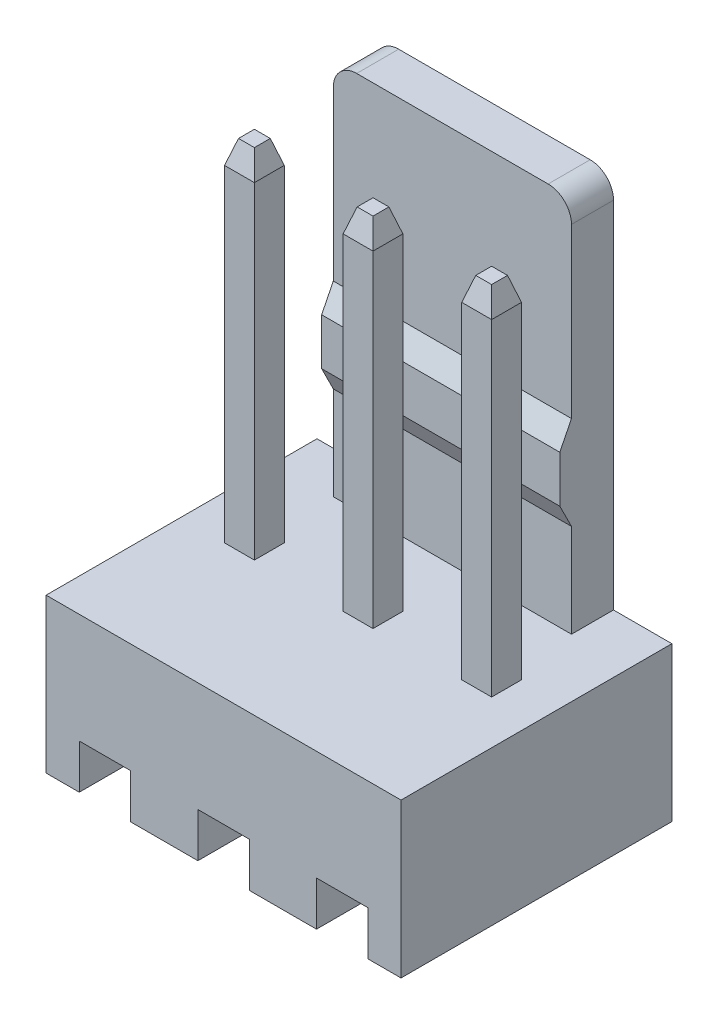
from build123d import *
from OCP.BRepFilletAPI import BRepFilletAPI_MakeChamfer

# Parameters (mm, degrees)
BASE_EXTRUDE_DEPTH  = 3.8
SKETCH2_W           = 2.25
SKETCH2_H           = 9.1
SKETCH2_W_2         = 1.1
SKETCH2_H_2         = 0.95
CUT_EXTRUDE1_DEPTH  = 14.343163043
FILLET1_R           = 0.5
SKETCH3_W           = 0.64
SKETCH3_H           = 0.64
BOSS_EXTRUDE1_DEPTH = 7.5
CHAMFER1_SIZE       = 0.5
CHAMFER1_SIZE2      = 0.15


with BuildPart() as part:
    # Sketch1 → Base-Extrude (new, symmetric)
    with BuildSketch(Plane(origin=(0, 0, 0), x_dir=(0, 0, -1), z_dir=(1, 0, 0))):
        Polygon((2.6, 0), (2.6, 11.4), (1.7, 11.4), (1.7, 7.3), (1.45, 6.8), (1.45, 5.8), (1.7, 5.3), (1.7, 3.3), (-3.2, 3.3), (-3.2, 0), align=None)
    extrude(amount=BASE_EXTRUDE_DEPTH, both=True)

    # Sketch2 → Cut-Extrude1 (cut, through all)
    with BuildSketch(Plane(origin=(0, 0, -2.6), x_dir=(-1, 0, 0), z_dir=(0, 0, -1))):
        with Locations((3.675, 7.85)):
            Rectangle(SKETCH2_W, SKETCH2_H)
        with Locations((-3.675, 7.85)):
            Rectangle(SKETCH2_W, SKETCH2_H)
        with Locations((0, 0.475)):
            Rectangle(SKETCH2_W_2, SKETCH2_H_2)
        with Locations((2.54, 0.475)):
            Rectangle(SKETCH2_W_2, SKETCH2_H_2)
        with Locations((-2.54, 0.475)):
            Rectangle(SKETCH2_W_2, SKETCH2_H_2)
    extrude(amount=-CUT_EXTRUDE1_DEPTH, mode=Mode.SUBTRACT)

    # Fillet1
    fillet1_edges = [part.edges().sort_by_distance(p)[0] for p in [
        (-2.55, 11.4, -2.15),
        (2.55, 11.4, -2.15),
    ]]
    fillet(fillet1_edges, radius=FILLET1_R)

    # Sketch3 → Boss-Extrude1 (add)
    with BuildSketch(Plane(origin=(0, 3.3, 0), x_dir=(-1, 0, 0), z_dir=(0, 1, 0))):
        with Locations((2.54, 0)):
            Rectangle(SKETCH3_W, SKETCH3_H)
        Rectangle(SKETCH3_W, SKETCH3_H)
        with Locations((-2.54, 0)):
            Rectangle(SKETCH3_W, SKETCH3_H)
    extrude(amount=BOSS_EXTRUDE1_DEPTH)

    # Chamfer1: one chamfer whose edges measure the first distance from different faces: ONE call of the kernel's chamfer builder (chamfer() names one face for all edges)
    chamfer1_edges_1 = [part.edges().sort_by_distance(p)[0] for p in [
        (0, 10.8, 0.32),
    ]]
    chamfer1_side_1 = [part.faces().sort_by_distance(p)[0] for p in [
        (0, 7.05, 0.32),
    ]]
    chamfer1_edges_2 = [part.edges().sort_by_distance(p)[0] for p in [
        (0.32, 10.8, 0),
    ]]
    chamfer1_side_2 = [part.faces().sort_by_distance(p)[0] for p in [
        (0.32, 7.05, 0),
    ]]
    chamfer1_edges_3 = [part.edges().sort_by_distance(p)[0] for p in [
        (0, 10.8, -0.32),
    ]]
    chamfer1_side_3 = [part.faces().sort_by_distance(p)[0] for p in [
        (0, 7.05, -0.32),
    ]]
    chamfer1_edges_4 = [part.edges().sort_by_distance(p)[0] for p in [
        (-0.32, 10.8, 0),
    ]]
    chamfer1_side_4 = [part.faces().sort_by_distance(p)[0] for p in [
        (-0.32, 7.05, 0),
    ]]
    chamfer1_edges_5 = [part.edges().sort_by_distance(p)[0] for p in [
        (2.54, 10.8, -0.32),
    ]]
    chamfer1_side_5 = [part.faces().sort_by_distance(p)[0] for p in [
        (2.54, 7.05, -0.32),
    ]]
    chamfer1_edges_6 = [part.edges().sort_by_distance(p)[0] for p in [
        (2.22, 10.8, 0),
    ]]
    chamfer1_side_6 = [part.faces().sort_by_distance(p)[0] for p in [
        (2.22, 7.05, 0),
    ]]
    chamfer1_edges_7 = [part.edges().sort_by_distance(p)[0] for p in [
        (2.54, 10.8, 0.32),
    ]]
    chamfer1_side_7 = [part.faces().sort_by_distance(p)[0] for p in [
        (2.54, 7.05, 0.32),
    ]]
    chamfer1_edges_8 = [part.edges().sort_by_distance(p)[0] for p in [
        (2.86, 10.8, 0),
    ]]
    chamfer1_side_8 = [part.faces().sort_by_distance(p)[0] for p in [
        (2.86, 7.05, 0),
    ]]
    chamfer1_edges_9 = [part.edges().sort_by_distance(p)[0] for p in [
        (-2.54, 10.8, 0.32),
    ]]
    chamfer1_side_9 = [part.faces().sort_by_distance(p)[0] for p in [
        (-2.54, 7.05, 0.32),
    ]]
    chamfer1_edges_10 = [part.edges().sort_by_distance(p)[0] for p in [
        (-2.22, 10.8, 0),
    ]]
    chamfer1_side_10 = [part.faces().sort_by_distance(p)[0] for p in [
        (-2.22, 7.05, 0),
    ]]
    chamfer1_edges_11 = [part.edges().sort_by_distance(p)[0] for p in [
        (-2.54, 10.8, -0.32),
    ]]
    chamfer1_side_11 = [part.faces().sort_by_distance(p)[0] for p in [
        (-2.54, 7.05, -0.32),
    ]]
    chamfer1_edges_12 = [part.edges().sort_by_distance(p)[0] for p in [
        (-2.86, 10.8, 0),
    ]]
    chamfer1_side_12 = [part.faces().sort_by_distance(p)[0] for p in [
        (-2.86, 7.05, 0),
    ]]
    chamfer1 = BRepFilletAPI_MakeChamfer(part.part.solid().wrapped)
    for e in chamfer1_edges_1:
        chamfer1.Add(CHAMFER1_SIZE, CHAMFER1_SIZE2, e.wrapped, chamfer1_side_1[0].wrapped)  # the first distance lies on this face
    for e in chamfer1_edges_2:
        chamfer1.Add(CHAMFER1_SIZE, CHAMFER1_SIZE2, e.wrapped, chamfer1_side_2[0].wrapped)  # the first distance lies on this face
    for e in chamfer1_edges_3:
        chamfer1.Add(CHAMFER1_SIZE, CHAMFER1_SIZE2, e.wrapped, chamfer1_side_3[0].wrapped)  # the first distance lies on this face
    for e in chamfer1_edges_4:
        chamfer1.Add(CHAMFER1_SIZE, CHAMFER1_SIZE2, e.wrapped, chamfer1_side_4[0].wrapped)  # the first distance lies on this face
    for e in chamfer1_edges_5:
        chamfer1.Add(CHAMFER1_SIZE, CHAMFER1_SIZE2, e.wrapped, chamfer1_side_5[0].wrapped)  # the first distance lies on this face
    for e in chamfer1_edges_6:
        chamfer1.Add(CHAMFER1_SIZE, CHAMFER1_SIZE2, e.wrapped, chamfer1_side_6[0].wrapped)  # the first distance lies on this face
    for e in chamfer1_edges_7:
        chamfer1.Add(CHAMFER1_SIZE, CHAMFER1_SIZE2, e.wrapped, chamfer1_side_7[0].wrapped)  # the first distance lies on this face
    for e in chamfer1_edges_8:
        chamfer1.Add(CHAMFER1_SIZE, CHAMFER1_SIZE2, e.wrapped, chamfer1_side_8[0].wrapped)  # the first distance lies on this face
    for e in chamfer1_edges_9:
        chamfer1.Add(CHAMFER1_SIZE, CHAMFER1_SIZE2, e.wrapped, chamfer1_side_9[0].wrapped)  # the first distance lies on this face
    for e in chamfer1_edges_10:
        chamfer1.Add(CHAMFER1_SIZE, CHAMFER1_SIZE2, e.wrapped, chamfer1_side_10[0].wrapped)  # the first distance lies on this face
    for e in chamfer1_edges_11:
        chamfer1.Add(CHAMFER1_SIZE, CHAMFER1_SIZE2, e.wrapped, chamfer1_side_11[0].wrapped)  # the first distance lies on this face
    for e in chamfer1_edges_12:
        chamfer1.Add(CHAMFER1_SIZE, CHAMFER1_SIZE2, e.wrapped, chamfer1_side_12[0].wrapped)  # the first distance lies on this face
    add(Compound.cast(chamfer1.Shape()), mode=Mode.REPLACE)


solid = part.part
